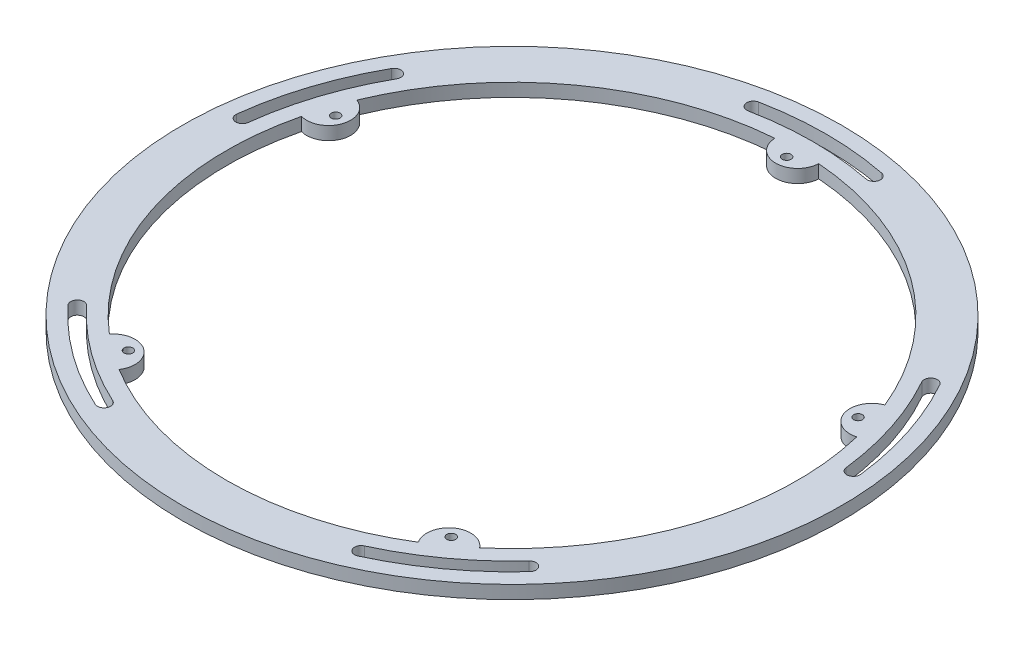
from build123d import *

# Parameters (mm, degrees)
ESQUISSE1_R        = 75
ESQUISSE1_R_2      = 1
BOSS_EXTRU_1_DEPTH = 3


with BuildPart() as part:
    # Esquisse1 → Boss.-Extru.1 (new body)
    with BuildSketch(Plane(origin=(0, 0, 0), x_dir=(1, 0, 0), z_dir=(0, 1, 0))):
        with Locations(Location((0, 0, 0), (0, 0, 270))):
            Circle(ESQUISSE1_R)
        with Locations(Location((0, 62.5, 0), (0, 0, 270))):
            Circle(ESQUISSE1_R_2, mode=Mode.SUBTRACT)
        with Locations(Location((59.441032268, 19.313562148, 0), (0, 0, 270))):
            Circle(ESQUISSE1_R_2, mode=Mode.SUBTRACT)
        with Locations(Location((36.736578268, -50.563562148, 0), (0, 0, 270))):
            Circle(ESQUISSE1_R_2, mode=Mode.SUBTRACT)
        with Locations(Location((-36.736578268, -50.563562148, 0), (0, 0, 270))):
            Circle(ESQUISSE1_R_2, mode=Mode.SUBTRACT)
        with Locations(Location((-59.441032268, 19.313562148, 0), (0, 0, 270))):
            Circle(ESQUISSE1_R_2, mode=Mode.SUBTRACT)
        with BuildLine():
            ThreePointArc((-14, 70.115975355), (-15.177258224, 68.351304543), (-13.412587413, 67.174046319))
            ThreePointArc((-13.412587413, 67.174046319), (0, 68.5), (13.412587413, 67.174046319))
            ThreePointArc((13.412587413, 67.174046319), (15.177258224, 68.351304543), (14, 70.115975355))
            ThreePointArc((14, 70.115975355), (0, 71.5), (-14, 70.115975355))
        make_face(mode=Mode.SUBTRACT)
        with BuildLine():
            ThreePointArc((62.358017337, 34.98181919), (60.315922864, 35.556145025), (59.741597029, 33.514050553))
            ThreePointArc((59.741597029, 33.514050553), (65.147371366, 21.167664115), (68.031031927, 8.001793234))
            ThreePointArc((68.031031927, 8.001793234), (69.695984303, 6.687284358), (71.010493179, 8.352236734))
            ThreePointArc((71.010493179, 8.352236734), (68.000540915, 22.094715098), (62.358017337, 34.98181919))
        make_face(mode=Mode.SUBTRACT)
        with BuildLine():
            ThreePointArc((52.539374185, -48.496022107), (52.454548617, -46.376398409), (50.334924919, -46.461223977))
            ThreePointArc((50.334924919, -46.461223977), (40.263289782, -55.417664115), (28.632902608, -62.228666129))
            ThreePointArc((28.632902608, -62.228666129), (27.897228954, -64.218335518), (29.886898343, -64.954009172))
            ThreePointArc((29.886898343, -64.954009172), (42.026645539, -57.844715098), (52.539374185, -48.496022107))
        make_face(mode=Mode.SUBTRACT)
        with BuildLine():
            ThreePointArc((-29.886898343, -64.954009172), (-27.897228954, -64.218335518), (-28.632902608, -62.228666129))
            ThreePointArc((-28.632902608, -62.228666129), (-40.263289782, -55.417664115), (-50.334924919, -46.461223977))
            ThreePointArc((-50.334924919, -46.461223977), (-52.454548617, -46.376398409), (-52.539374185, -48.496022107))
            ThreePointArc((-52.539374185, -48.496022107), (-42.026645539, -57.844715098), (-29.886898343, -64.954009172))
        make_face(mode=Mode.SUBTRACT)
        with BuildLine():
            ThreePointArc((-71.010493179, 8.352236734), (-69.695984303, 6.687284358), (-68.031031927, 8.001793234))
            ThreePointArc((-68.031031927, 8.001793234), (-65.147371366, 21.167664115), (-59.741597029, 33.514050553))
            ThreePointArc((-59.741597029, 33.514050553), (-60.315922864, 35.556145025), (-62.358017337, 34.98181919))
            ThreePointArc((-62.358017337, 34.98181919), (-68.000540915, 22.094715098), (-71.010493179, 8.352236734))
        make_face(mode=Mode.SUBTRACT)
        with BuildLine():
            ThreePointArc((-42.135097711, -49.493772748), (-35.267115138, -48.541019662), (-34.050913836, -55.367276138))
            ThreePointArc((-34.050913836, -55.367276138), (0, -65), (34.050913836, -55.367276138))
            ThreePointArc((34.050913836, -55.367276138), (35.267115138, -48.541019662), (42.135097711, -49.493772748))
            ThreePointArc((42.135097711, -49.493772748), (61.818673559, -20.086104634), (63.17971981, 15.27491423))
            ThreePointArc((63.17971981, 15.27491423), (57.063390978, 18.541019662), (60.091836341, 24.778442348))
            ThreePointArc((60.091836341, 24.778442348), (38.206041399, 52.586104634), (4.996300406, 64.807692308))
            ThreePointArc((4.996300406, 64.807692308), (0, 60), (-4.996300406, 64.807692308))
            ThreePointArc((-4.996300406, 64.807692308), (-38.206041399, 52.586104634), (-60.091836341, 24.778442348))
            ThreePointArc((-60.091836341, 24.778442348), (-57.063390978, 18.541019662), (-63.17971981, 15.27491423))
            ThreePointArc((-63.17971981, 15.27491423), (-61.818673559, -20.086104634), (-42.135097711, -49.493772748))
        make_face(mode=Mode.SUBTRACT)
    extrude(amount=BOSS_EXTRU_1_DEPTH)


solid = part.part
